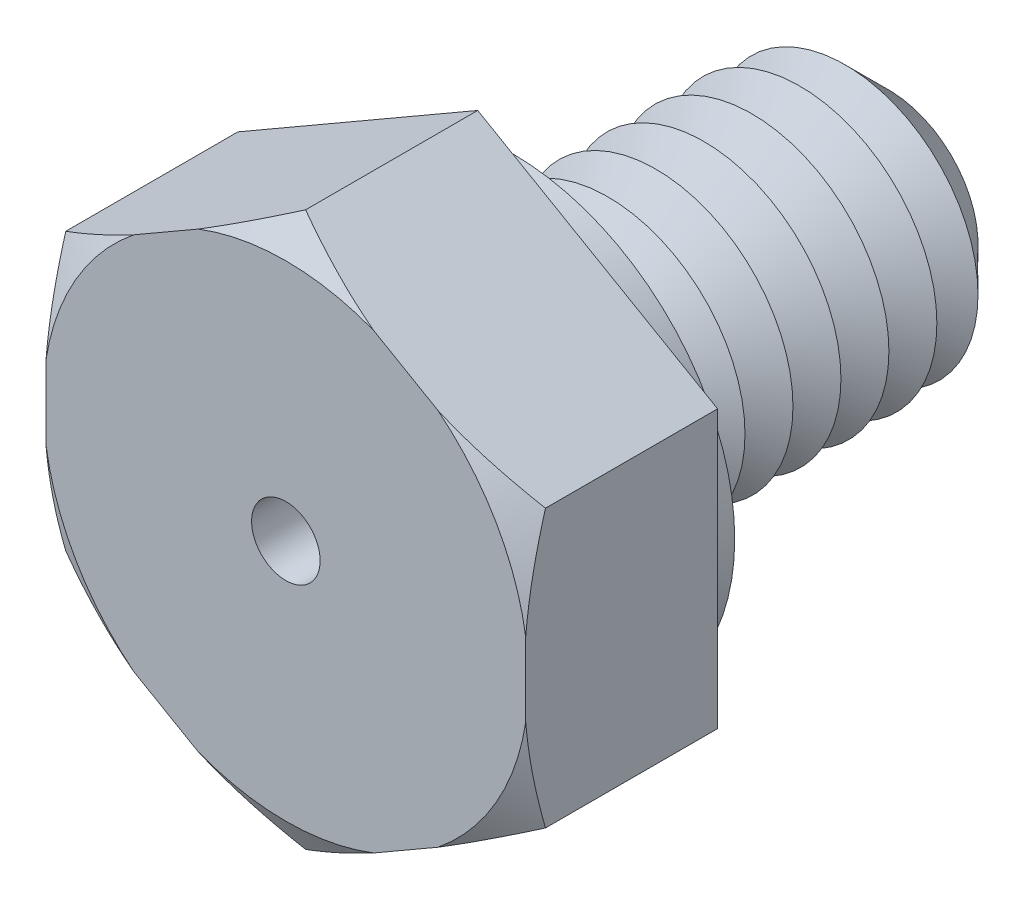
from build123d import *

# Parameters (mm, degrees)
BOSS_EXTRUDE1_DEPTH = 2.8
SKETCH3_R           = 2
BOSS_EXTRUDE2_DEPTH = 6
SKETCH4_R           = 3.25
BOSS_EXTRUDE3_DEPTH = 0.5
CHAMFER1_SIZE       = 0.7
LPATTERN1_COUNT     = 7
LPATTERN1_PITCH     = 0.7
SKETCH8_R           = 0.5
CUT_EXTRUDE1_DEPTH  = 8.8


with BuildPart() as part:
    # Sketch2 → Boss-Extrude1 (new body)
    with BuildSketch(Plane.XY):
        Polygon((0, 4.041451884), (-3.5, 2.020725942), (-3.5, -2.020725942), (0, -4.041451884), (3.5, -2.020725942), (3.5, 2.020725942), align=None)
    extrude(amount=BOSS_EXTRUDE1_DEPTH)

    # Sketch3 → Boss-Extrude2 (add)
    with BuildSketch(Plane(origin=(0, 0, 0), x_dir=(-1, 0, 0), z_dir=(0, 0, -1))):
        Circle(SKETCH3_R)
    extrude(amount=BOSS_EXTRUDE2_DEPTH)

    # Sketch4 → Boss-Extrude3 (add)
    with BuildSketch(Plane(origin=(0, 0, 0), x_dir=(-1, 0, 0), z_dir=(0, 0, -1))):
        with Locations(Location((0, 0, 0), (0, 0, 180))):
            Circle(SKETCH4_R)
    extrude(amount=BOSS_EXTRUDE3_DEPTH)

    # Chamfer1
    chamfer1_edges = [part.edges().sort_by_distance(p)[0] for p in [
        (2, 0, -6),
    ]]
    chamfer(chamfer1_edges, length=CHAMFER1_SIZE)

    # Sketch6 → Cut-Revolve1 (revolve, cut)
    with BuildSketch(Plane(origin=(0, 0, 0), x_dir=(0, 0, -1), z_dir=(1, 0, 0)), mode=Mode.PRIVATE) as cut_revolve1_sk:
        Polygon((0.5, 2), (0.85, 1.393782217), (1.2, 2), align=None)
    cut_revolve1 = revolve(cut_revolve1_sk.sketch.rotate(Axis((0, 0, 3.211670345), (0, 0, -1)), 90), axis=Axis((0, 0, 3.211670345), (0, 0, -1)), mode=Mode.SUBTRACT)

    # LPattern1: Cut-Revolve1 ×7
    with Locations(*[(0, 0, -i * LPATTERN1_PITCH) for i in range(1, LPATTERN1_COUNT)]):
        add(cut_revolve1, mode=Mode.SUBTRACT)

    # Sketch7 → Cut-Revolve2 (revolve, cut)
    with BuildSketch(Plane(origin=(0, 0, 0), x_dir=(0, 0, -1), z_dir=(1, 0, 0)), mode=Mode.PRIVATE) as cut_revolve2_sk:
        Polygon((-2.8, 4.041451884), (-2.8, 3.541451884), (-2.511324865, 4.041451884), align=None)
    revolve(cut_revolve2_sk.sketch.rotate(Axis((0, 0, 3.211670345), (0, 0, -1)), 270), axis=Axis((0, 0, 3.211670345), (0, 0, -1)), mode=Mode.SUBTRACT)

    # Sketch8 → Cut-Extrude1 (cut)
    with BuildSketch(Plane.XY.offset(2.8)):
        Circle(SKETCH8_R)
    extrude(amount=-CUT_EXTRUDE1_DEPTH, mode=Mode.SUBTRACT)


solid = part.part
